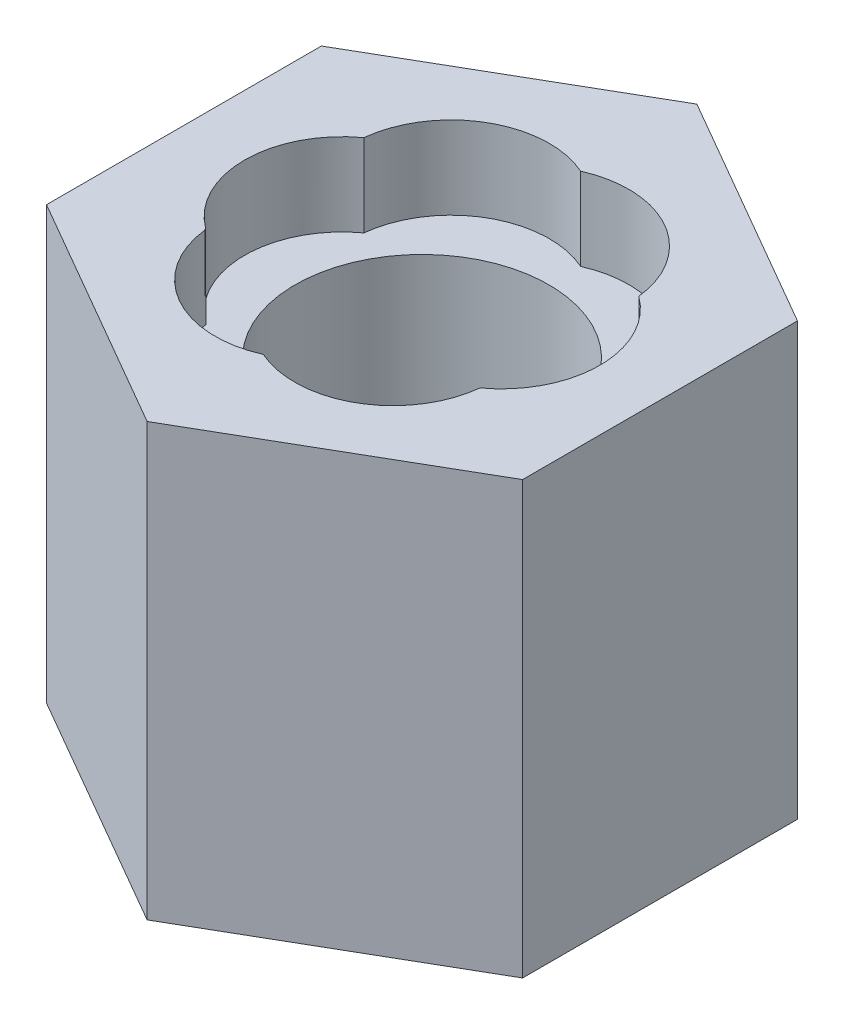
ISO-10303-21;
HEADER;
FILE_DESCRIPTION(('STEP AP214'),'2;1');
FILE_NAME('part.step','',(''),(''),'','','');
FILE_SCHEMA(('AUTOMOTIVE_DESIGN { 1 0 10303 214 1 1 1 1 }'));
ENDSEC;
DATA;
#1=APPLICATION_CONTEXT('core data for automotive mechanical design processes');
#2=APPLICATION_PROTOCOL_DEFINITION('international standard','automotive_design',2000,#1);
#3=PRODUCT_CONTEXT('',#1,'mechanical');
#4=PRODUCT('Part','Part','',(#3));
#5=PRODUCT_RELATED_PRODUCT_CATEGORY('part','',(#4));
#6=PRODUCT_DEFINITION_FORMATION('','',#4);
#7=PRODUCT_DEFINITION_CONTEXT('part definition',#1,'design');
#8=PRODUCT_DEFINITION('design','',#6,#7);
#9=PRODUCT_DEFINITION_SHAPE('','',#8);
#10=(LENGTH_UNIT() NAMED_UNIT(*) SI_UNIT(.MILLI.,.METRE.));
#11=(NAMED_UNIT(*) PLANE_ANGLE_UNIT() SI_UNIT($,.RADIAN.));
#12=(NAMED_UNIT(*) SI_UNIT($,.STERADIAN.) SOLID_ANGLE_UNIT());
#13=UNCERTAINTY_MEASURE_WITH_UNIT(LENGTH_MEASURE(1.E-05),#10,'distance_accuracy_value','');
#14=(GEOMETRIC_REPRESENTATION_CONTEXT(3) GLOBAL_UNCERTAINTY_ASSIGNED_CONTEXT((#13)) GLOBAL_UNIT_ASSIGNED_CONTEXT((#10,
#11,#12)) REPRESENTATION_CONTEXT('',''));
#15=CARTESIAN_POINT('',(0.,0.,0.));
#16=DIRECTION('',(0.,0.,1.));
#17=DIRECTION('',(1.,0.,0.));
#18=AXIS2_PLACEMENT_3D('',#15,#16,#17);
#19=CARTESIAN_POINT('',(37.4999999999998,10.,-64.95));
#20=DIRECTION('',(0.,1.,0.));
#21=DIRECTION('',(0.,0.,1.));
#22=AXIS2_PLACEMENT_3D('',#19,#20,#21);
#23=CYLINDRICAL_SURFACE('',#22,10.);
#24=CARTESIAN_POINT('',(37.4999999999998,0.,-64.95));
#25=DIRECTION('',(0.,1.,0.));
#26=DIRECTION('',(0.,0.,1.));
#27=AXIS2_PLACEMENT_3D('',#24,#25,#26);
#28=CIRCLE('',#27,10.);
#29=CARTESIAN_POINT('',(37.4999999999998,0.,-54.95));
#30=VERTEX_POINT('',#29);
#31=EDGE_CURVE('E180',#30,#30,#28,.T.);
#32=ORIENTED_EDGE('',*,*,#31,.F.);
#33=EDGE_LOOP('',(#32));
#34=FACE_BOUND('',#33,.T.);
#35=CARTESIAN_POINT('',(37.4999999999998,27.5,-64.95));
#36=DIRECTION('',(0.,1.,0.));
#37=DIRECTION('',(0.,0.,1.));
#38=AXIS2_PLACEMENT_3D('',#35,#36,#37);
#39=CIRCLE('',#38,10.);
#40=CARTESIAN_POINT('',(37.4999999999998,27.5,-54.95));
#41=VERTEX_POINT('',#40);
#42=EDGE_CURVE('E436',#41,#41,#39,.T.);
#43=ORIENTED_EDGE('',*,*,#42,.T.);
#44=EDGE_LOOP('',(#43));
#45=FACE_BOUND('',#44,.T.);
#46=ADVANCED_FACE('F33',(#34,#45),#23,.F.);
#47=CARTESIAN_POINT('',(-39.812134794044,34.,-64.95));
#48=DIRECTION('',(0.,1.,0.));
#49=DIRECTION('',(0.,0.,1.));
#50=AXIS2_PLACEMENT_3D('',#47,#48,#49);
#51=PLANE('',#50);
#52=DIRECTION('',(-0.866025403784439,0.,-0.5));
#53=VECTOR('',#52,1.);
#54=CARTESIAN_POINT('',(-11.1091010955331,34.,-114.665112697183));
#55=LINE('',#54,#53);
#56=CARTESIAN_POINT('',(56.2499999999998,34.,-75.7753175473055));
#57=VERTEX_POINT('',#56);
#58=CARTESIAN_POINT('',(37.4999999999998,34.,-86.600635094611));
#59=VERTEX_POINT('',#58);
#60=EDGE_CURVE('E144',#57,#59,#55,.T.);
#61=ORIENTED_EDGE('',*,*,#60,.T.);
#62=DIRECTION('',(-0.866025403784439,0.,0.499999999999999));
#63=VECTOR('',#62,1.);
#64=CARTESIAN_POINT('',(-29.8591010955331,34.,-47.7108399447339));
#65=LINE('',#64,#63);
#66=CARTESIAN_POINT('',(18.7499999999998,34.,-75.7753175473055));
#67=VERTEX_POINT('',#66);
#68=EDGE_CURVE('E93',#59,#67,#65,.T.);
#69=ORIENTED_EDGE('',*,*,#68,.T.);
#70=DIRECTION('',(0.,0.,-1.));
#71=VECTOR('',#70,1.);
#72=CARTESIAN_POINT('',(18.7499999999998,34.,-64.95));
#73=LINE('',#72,#71);
#74=CARTESIAN_POINT('',(18.7499999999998,34.,-54.1246824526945));
#75=VERTEX_POINT('',#74);
#76=EDGE_CURVE('E111',#75,#67,#73,.T.);
#77=ORIENTED_EDGE('',*,*,#76,.F.);
#78=DIRECTION('',(0.866025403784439,0.,0.5));
#79=VECTOR('',#78,1.);
#80=CARTESIAN_POINT('',(-29.859101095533,34.,-82.1891600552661));
#81=LINE('',#80,#79);
#82=CARTESIAN_POINT('',(37.4999999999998,34.,-43.299364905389));
#83=VERTEX_POINT('',#82);
#84=EDGE_CURVE('E103',#75,#83,#81,.T.);
#85=ORIENTED_EDGE('',*,*,#84,.T.);
#86=DIRECTION('',(0.866025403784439,0.,-0.5));
#87=VECTOR('',#86,1.);
#88=CARTESIAN_POINT('',(-11.109101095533,34.,-15.2348873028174));
#89=LINE('',#88,#87);
#90=CARTESIAN_POINT('',(56.2499999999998,34.,-54.1246824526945));
#91=VERTEX_POINT('',#90);
#92=EDGE_CURVE('E108',#83,#91,#89,.T.);
#93=ORIENTED_EDGE('',*,*,#92,.T.);
#94=DIRECTION('',(0.,0.,-1.));
#95=VECTOR('',#94,1.);
#96=CARTESIAN_POINT('',(56.2499999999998,34.,-64.95));
#97=LINE('',#96,#95);
#98=EDGE_CURVE('E57',#91,#57,#97,.T.);
#99=ORIENTED_EDGE('',*,*,#98,.T.);
#100=EDGE_LOOP('',(#61,#69,#77,#85,#93,#99));
#101=FACE_BOUND('',#100,.T.);
#102=CARTESIAN_POINT('',(40.6302343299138,34.,-59.5282751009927));
#103=DIRECTION('',(0.,1.,0.));
#104=DIRECTION('',(0.,0.,1.));
#105=AXIS2_PLACEMENT_3D('',#102,#103,#104);
#106=CIRCLE('',#105,7.73953134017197);
#107=CARTESIAN_POINT('',(48.3253175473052,34.,-58.7));
#108=VERTEX_POINT('',#107);
#109=CARTESIAN_POINT('',(37.4999999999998,34.,-52.45));
#110=VERTEX_POINT('',#109);
#111=EDGE_CURVE('E413',#108,#110,#106,.F.);
#112=ORIENTED_EDGE('',*,*,#111,.T.);
#113=CARTESIAN_POINT('',(34.3671378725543,34.,-59.4777451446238));
#114=DIRECTION('',(0.,1.,0.));
#115=DIRECTION('',(0.,0.,1.));
#116=AXIS2_PLACEMENT_3D('',#113,#114,#115);
#117=CIRCLE('',#116,7.69441530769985);
#118=CARTESIAN_POINT('',(26.7205431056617,34.,-58.6212316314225));
#119=VERTEX_POINT('',#118);
#120=EDGE_CURVE('E408',#110,#119,#117,.F.);
#121=ORIENTED_EDGE('',*,*,#120,.T.);
#122=CARTESIAN_POINT('',(37.4999999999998,34.,-64.95));
#123=DIRECTION('',(0.,1.,0.));
#124=DIRECTION('',(0.,0.,1.));
#125=AXIS2_PLACEMENT_3D('',#122,#123,#124);
#126=CIRCLE('',#125,12.5);
#127=CARTESIAN_POINT('',(26.6293920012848,34.,-58.7791101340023));
#128=VERTEX_POINT('',#127);
#129=EDGE_CURVE('E134',#128,#119,#126,.T.);
#130=ORIENTED_EDGE('',*,*,#129,.F.);
#131=CARTESIAN_POINT('',(31.1944518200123,34.,-64.9729920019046));
#132=DIRECTION('',(0.,1.,0.));
#133=DIRECTION('',(0.,0.,1.));
#134=AXIS2_PLACEMENT_3D('',#131,#132,#133);
#135=CIRCLE('',#134,7.69440990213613);
#136=CARTESIAN_POINT('',(26.6746824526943,34.,-71.2));
#137=VERTEX_POINT('',#136);
#138=EDGE_CURVE('E415',#137,#128,#135,.T.);
#139=ORIENTED_EDGE('',*,*,#138,.F.);
#140=CARTESIAN_POINT('',(34.3697656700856,34.,-70.3717248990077));
#141=DIRECTION('',(0.,1.,0.));
#142=DIRECTION('',(0.,0.,1.));
#143=AXIS2_PLACEMENT_3D('',#140,#141,#142);
#144=CIRCLE('',#143,7.73953134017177);
#145=CARTESIAN_POINT('',(37.4999999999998,34.,-77.45));
#146=VERTEX_POINT('',#145);
#147=EDGE_CURVE('E420',#146,#137,#144,.T.);
#148=ORIENTED_EDGE('',*,*,#147,.F.);
#149=CARTESIAN_POINT('',(40.6302343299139,34.,-70.3717248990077));
#150=DIRECTION('',(0.,1.,0.));
#151=DIRECTION('',(0.,0.,1.));
#152=AXIS2_PLACEMENT_3D('',#149,#150,#151);
#153=CIRCLE('',#152,7.73953134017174);
#154=CARTESIAN_POINT('',(48.3253175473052,34.,-71.2000000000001));
#155=VERTEX_POINT('',#154);
#156=EDGE_CURVE('E483',#146,#155,#153,.F.);
#157=ORIENTED_EDGE('',*,*,#156,.T.);
#158=CARTESIAN_POINT('',(43.7604686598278,34.,-64.9500000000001));
#159=DIRECTION('',(0.,1.,0.));
#160=DIRECTION('',(0.,0.,1.));
#161=AXIS2_PLACEMENT_3D('',#158,#159,#160);
#162=CIRCLE('',#161,7.73953134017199);
#163=EDGE_CURVE('E481',#155,#108,#162,.F.);
#164=ORIENTED_EDGE('',*,*,#163,.T.);
#165=EDGE_LOOP('',(#112,#121,#130,#139,#148,#157,#164));
#166=FACE_BOUND('',#165,.T.);
#167=ADVANCED_FACE('F105',(#101,#166),#51,.T.);
#168=CARTESIAN_POINT('',(37.4999999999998,30.,-64.95));
#169=DIRECTION('',(0.,1.,0.));
#170=DIRECTION('',(0.,0.,1.));
#171=AXIS2_PLACEMENT_3D('',#168,#169,#170);
#172=CYLINDRICAL_SURFACE('',#171,12.5);
#173=DIRECTION('',(0.,1.,0.));
#174=VECTOR('',#173,1.);
#175=CARTESIAN_POINT('',(26.7205431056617,30.75,-58.6212316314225));
#176=LINE('',#175,#174);
#177=CARTESIAN_POINT('',(26.7205431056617,29.5,-58.6212316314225));
#178=VERTEX_POINT('',#177);
#179=EDGE_CURVE('E181',#178,#119,#176,.T.);
#180=ORIENTED_EDGE('',*,*,#179,.F.);
#181=CARTESIAN_POINT('',(37.4999999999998,29.5,-64.95));
#182=DIRECTION('',(0.,1.,0.));
#183=DIRECTION('',(0.,0.,1.));
#184=AXIS2_PLACEMENT_3D('',#181,#182,#183);
#185=CIRCLE('',#184,12.5);
#186=CARTESIAN_POINT('',(26.6293920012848,29.5,-58.7791101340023));
#187=VERTEX_POINT('',#186);
#188=EDGE_CURVE('E178',#187,#178,#185,.T.);
#189=ORIENTED_EDGE('',*,*,#188,.F.);
#190=DIRECTION('',(0.,1.,0.));
#191=VECTOR('',#190,1.);
#192=CARTESIAN_POINT('',(26.6293920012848,30.75,-58.7791101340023));
#193=LINE('',#192,#191);
#194=EDGE_CURVE('E48',#187,#128,#193,.T.);
#195=ORIENTED_EDGE('',*,*,#194,.T.);
#196=ORIENTED_EDGE('',*,*,#129,.T.);
#197=EDGE_LOOP('',(#180,#189,#195,#196));
#198=FACE_BOUND('',#197,.T.);
#199=ADVANCED_FACE('F214',(#198),#172,.F.);
#200=CARTESIAN_POINT('',(37.4999999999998,29.5,-64.95));
#201=DIRECTION('',(0.,1.,0.));
#202=DIRECTION('',(0.,0.,1.));
#203=AXIS2_PLACEMENT_3D('',#200,#201,#202);
#204=PLANE('',#203);
#205=ORIENTED_EDGE('',*,*,#188,.T.);
#206=CARTESIAN_POINT('',(34.3671378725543,29.5,-59.4777451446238));
#207=DIRECTION('',(0.,1.,0.));
#208=DIRECTION('',(0.,0.,1.));
#209=AXIS2_PLACEMENT_3D('',#206,#207,#208);
#210=CIRCLE('',#209,7.69441530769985);
#211=CARTESIAN_POINT('',(26.7100809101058,29.5,-58.7204436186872));
#212=VERTEX_POINT('',#211);
#213=EDGE_CURVE('E11',#178,#212,#210,.F.);
#214=ORIENTED_EDGE('',*,*,#213,.T.);
#215=CARTESIAN_POINT('',(31.1944518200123,29.5,-64.9729920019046));
#216=DIRECTION('',(0.,1.,0.));
#217=DIRECTION('',(0.,0.,1.));
#218=AXIS2_PLACEMENT_3D('',#215,#216,#217);
#219=CIRCLE('',#218,7.69440990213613);
#220=EDGE_CURVE('E41',#187,#212,#219,.T.);
#221=ORIENTED_EDGE('',*,*,#220,.F.);
#222=EDGE_LOOP('',(#205,#214,#221));
#223=FACE_BOUND('',#222,.T.);
#224=ADVANCED_FACE('F177',(#223),#204,.T.);
#225=CARTESIAN_POINT('',(-11.1091010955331,34.,-114.665112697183));
#226=DIRECTION('',(-0.5,0.,0.866025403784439));
#227=DIRECTION('',(0.866025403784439,0.,0.5));
#228=AXIS2_PLACEMENT_3D('',#225,#226,#227);
#229=PLANE('',#228);
#230=DIRECTION('',(-0.866025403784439,0.,-0.5));
#231=VECTOR('',#230,1.);
#232=CARTESIAN_POINT('',(-11.1091010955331,0.,-114.665112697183));
#233=LINE('',#232,#231);
#234=CARTESIAN_POINT('',(56.2499999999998,0.,-75.7753175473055));
#235=VERTEX_POINT('',#234);
#236=CARTESIAN_POINT('',(37.4999999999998,0.,-86.600635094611));
#237=VERTEX_POINT('',#236);
#238=EDGE_CURVE('E130',#235,#237,#233,.T.);
#239=ORIENTED_EDGE('',*,*,#238,.T.);
#240=DIRECTION('',(0.,-1.,0.));
#241=VECTOR('',#240,1.);
#242=CARTESIAN_POINT('',(37.4999999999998,34.,-86.600635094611));
#243=LINE('',#242,#241);
#244=EDGE_CURVE('E150',#59,#237,#243,.T.);
#245=ORIENTED_EDGE('',*,*,#244,.F.);
#246=ORIENTED_EDGE('',*,*,#60,.F.);
#247=DIRECTION('',(0.,-1.,0.));
#248=VECTOR('',#247,1.);
#249=CARTESIAN_POINT('',(56.2499999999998,34.,-75.7753175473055));
#250=LINE('',#249,#248);
#251=EDGE_CURVE('E126',#57,#235,#250,.T.);
#252=ORIENTED_EDGE('',*,*,#251,.T.);
#253=EDGE_LOOP('',(#239,#245,#246,#252));
#254=FACE_BOUND('',#253,.T.);
#255=ADVANCED_FACE('F35',(#254),#229,.F.);
#256=CARTESIAN_POINT('',(-29.8591010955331,34.,-47.7108399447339));
#257=DIRECTION('',(0.499999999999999,0.,0.866025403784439));
#258=DIRECTION('',(0.866025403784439,0.,-0.499999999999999));
#259=AXIS2_PLACEMENT_3D('',#256,#257,#258);
#260=PLANE('',#259);
#261=DIRECTION('',(-0.866025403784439,0.,0.499999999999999));
#262=VECTOR('',#261,1.);
#263=CARTESIAN_POINT('',(-29.8591010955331,0.,-47.7108399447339));
#264=LINE('',#263,#262);
#265=CARTESIAN_POINT('',(18.7499999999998,0.,-75.7753175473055));
#266=VERTEX_POINT('',#265);
#267=EDGE_CURVE('E133',#237,#266,#264,.T.);
#268=ORIENTED_EDGE('',*,*,#267,.T.);
#269=DIRECTION('',(0.,-1.,0.));
#270=VECTOR('',#269,1.);
#271=CARTESIAN_POINT('',(18.7499999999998,34.,-75.7753175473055));
#272=LINE('',#271,#270);
#273=EDGE_CURVE('E148',#67,#266,#272,.T.);
#274=ORIENTED_EDGE('',*,*,#273,.F.);
#275=ORIENTED_EDGE('',*,*,#68,.F.);
#276=ORIENTED_EDGE('',*,*,#244,.T.);
#277=EDGE_LOOP('',(#268,#274,#275,#276));
#278=FACE_BOUND('',#277,.T.);
#279=ADVANCED_FACE('F201',(#278),#260,.F.);
#280=CARTESIAN_POINT('',(18.7499999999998,34.,-64.95));
#281=DIRECTION('',(-1.,0.,0.));
#282=DIRECTION('',(0.,0.,1.));
#283=AXIS2_PLACEMENT_3D('',#280,#281,#282);
#284=PLANE('',#283);
#285=DIRECTION('',(0.,0.,-1.));
#286=VECTOR('',#285,1.);
#287=CARTESIAN_POINT('',(18.7499999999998,0.,-64.95));
#288=LINE('',#287,#286);
#289=CARTESIAN_POINT('',(18.7499999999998,0.,-54.1246824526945));
#290=VERTEX_POINT('',#289);
#291=EDGE_CURVE('E137',#290,#266,#288,.T.);
#292=ORIENTED_EDGE('',*,*,#291,.F.);
#293=DIRECTION('',(0.,-1.,0.));
#294=VECTOR('',#293,1.);
#295=CARTESIAN_POINT('',(18.7499999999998,34.,-54.1246824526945));
#296=LINE('',#295,#294);
#297=EDGE_CURVE('E121',#75,#290,#296,.T.);
#298=ORIENTED_EDGE('',*,*,#297,.F.);
#299=ORIENTED_EDGE('',*,*,#76,.T.);
#300=ORIENTED_EDGE('',*,*,#273,.T.);
#301=EDGE_LOOP('',(#292,#298,#299,#300));
#302=FACE_BOUND('',#301,.T.);
#303=ADVANCED_FACE('F193',(#302),#284,.T.);
#304=CARTESIAN_POINT('',(-29.859101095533,34.,-82.1891600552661));
#305=DIRECTION('',(0.5,0.,-0.866025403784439));
#306=DIRECTION('',(-0.866025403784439,0.,-0.5));
#307=AXIS2_PLACEMENT_3D('',#304,#305,#306);
#308=PLANE('',#307);
#309=DIRECTION('',(0.866025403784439,0.,0.5));
#310=VECTOR('',#309,1.);
#311=CARTESIAN_POINT('',(-29.859101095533,0.,-82.1891600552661));
#312=LINE('',#311,#310);
#313=CARTESIAN_POINT('',(37.4999999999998,0.,-43.299364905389));
#314=VERTEX_POINT('',#313);
#315=EDGE_CURVE('E118',#290,#314,#312,.T.);
#316=ORIENTED_EDGE('',*,*,#315,.T.);
#317=DIRECTION('',(0.,-1.,0.));
#318=VECTOR('',#317,1.);
#319=CARTESIAN_POINT('',(37.4999999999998,34.,-43.299364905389));
#320=LINE('',#319,#318);
#321=EDGE_CURVE('E115',#83,#314,#320,.T.);
#322=ORIENTED_EDGE('',*,*,#321,.F.);
#323=ORIENTED_EDGE('',*,*,#84,.F.);
#324=ORIENTED_EDGE('',*,*,#297,.T.);
#325=EDGE_LOOP('',(#316,#322,#323,#324));
#326=FACE_BOUND('',#325,.T.);
#327=ADVANCED_FACE('F116',(#326),#308,.F.);
#328=CARTESIAN_POINT('',(-11.109101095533,34.,-15.2348873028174));
#329=DIRECTION('',(-0.5,0.,-0.866025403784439));
#330=DIRECTION('',(-0.866025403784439,0.,0.5));
#331=AXIS2_PLACEMENT_3D('',#328,#329,#330);
#332=PLANE('',#331);
#333=DIRECTION('',(0.866025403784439,0.,-0.5));
#334=VECTOR('',#333,1.);
#335=CARTESIAN_POINT('',(-11.109101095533,0.,-15.2348873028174));
#336=LINE('',#335,#334);
#337=CARTESIAN_POINT('',(56.2499999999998,0.,-54.1246824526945));
#338=VERTEX_POINT('',#337);
#339=EDGE_CURVE('E141',#314,#338,#336,.T.);
#340=ORIENTED_EDGE('',*,*,#339,.T.);
#341=DIRECTION('',(0.,-1.,0.));
#342=VECTOR('',#341,1.);
#343=CARTESIAN_POINT('',(56.2499999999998,34.,-54.1246824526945));
#344=LINE('',#343,#342);
#345=EDGE_CURVE('E122',#91,#338,#344,.T.);
#346=ORIENTED_EDGE('',*,*,#345,.F.);
#347=ORIENTED_EDGE('',*,*,#92,.F.);
#348=ORIENTED_EDGE('',*,*,#321,.T.);
#349=EDGE_LOOP('',(#340,#346,#347,#348));
#350=FACE_BOUND('',#349,.T.);
#351=ADVANCED_FACE('F124',(#350),#332,.F.);
#352=CARTESIAN_POINT('',(56.2499999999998,34.,-64.95));
#353=DIRECTION('',(-1.,0.,0.));
#354=DIRECTION('',(0.,0.,1.));
#355=AXIS2_PLACEMENT_3D('',#352,#353,#354);
#356=PLANE('',#355);
#357=DIRECTION('',(0.,0.,-1.));
#358=VECTOR('',#357,1.);
#359=CARTESIAN_POINT('',(56.2499999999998,0.,-64.95));
#360=LINE('',#359,#358);
#361=EDGE_CURVE('E84',#338,#235,#360,.T.);
#362=ORIENTED_EDGE('',*,*,#361,.T.);
#363=ORIENTED_EDGE('',*,*,#251,.F.);
#364=ORIENTED_EDGE('',*,*,#98,.F.);
#365=ORIENTED_EDGE('',*,*,#345,.T.);
#366=EDGE_LOOP('',(#362,#363,#364,#365));
#367=FACE_BOUND('',#366,.T.);
#368=ADVANCED_FACE('F197',(#367),#356,.F.);
#369=CARTESIAN_POINT('',(-39.812134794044,0.,-64.95));
#370=DIRECTION('',(0.,1.,0.));
#371=DIRECTION('',(0.,0.,1.));
#372=AXIS2_PLACEMENT_3D('',#369,#370,#371);
#373=PLANE('',#372);
#374=ORIENTED_EDGE('',*,*,#31,.T.);
#375=EDGE_LOOP('',(#374));
#376=FACE_BOUND('',#375,.T.);
#377=ORIENTED_EDGE('',*,*,#238,.F.);
#378=ORIENTED_EDGE('',*,*,#361,.F.);
#379=ORIENTED_EDGE('',*,*,#339,.F.);
#380=ORIENTED_EDGE('',*,*,#315,.F.);
#381=ORIENTED_EDGE('',*,*,#291,.T.);
#382=ORIENTED_EDGE('',*,*,#267,.F.);
#383=EDGE_LOOP('',(#377,#378,#379,#380,#381,#382));
#384=FACE_BOUND('',#383,.T.);
#385=ADVANCED_FACE('F196',(#376,#384),#373,.F.);
#386=CARTESIAN_POINT('',(34.3671378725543,27.5,-59.4777451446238));
#387=DIRECTION('',(0.,1.,0.));
#388=DIRECTION('',(0.,0.,1.));
#389=AXIS2_PLACEMENT_3D('',#386,#387,#388);
#390=CYLINDRICAL_SURFACE('',#389,7.69441530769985);
#391=ORIENTED_EDGE('',*,*,#179,.T.);
#392=ORIENTED_EDGE('',*,*,#120,.F.);
#393=DIRECTION('',(0.,1.,0.));
#394=VECTOR('',#393,1.);
#395=CARTESIAN_POINT('',(37.4999999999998,27.5,-52.45));
#396=LINE('',#395,#394);
#397=CARTESIAN_POINT('',(37.4999999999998,27.5,-52.45));
#398=VERTEX_POINT('',#397);
#399=EDGE_CURVE('E174',#398,#110,#396,.T.);
#400=ORIENTED_EDGE('',*,*,#399,.F.);
#401=CARTESIAN_POINT('',(34.3671378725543,27.5,-59.4777451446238));
#402=DIRECTION('',(0.,1.,0.));
#403=DIRECTION('',(0.,0.,1.));
#404=AXIS2_PLACEMENT_3D('',#401,#402,#403);
#405=CIRCLE('',#404,7.69441530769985);
#406=CARTESIAN_POINT('',(26.7100809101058,27.5,-58.7204436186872));
#407=VERTEX_POINT('',#406);
#408=EDGE_CURVE('E173',#398,#407,#405,.F.);
#409=ORIENTED_EDGE('',*,*,#408,.T.);
#410=DIRECTION('',(0.,1.,0.));
#411=VECTOR('',#410,1.);
#412=CARTESIAN_POINT('',(26.7100809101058,27.5,-58.7204436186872));
#413=LINE('',#412,#411);
#414=EDGE_CURVE('E157',#407,#212,#413,.T.);
#415=ORIENTED_EDGE('',*,*,#414,.T.);
#416=ORIENTED_EDGE('',*,*,#213,.F.);
#417=EDGE_LOOP('',(#391,#392,#400,#409,#415,#416));
#418=FACE_BOUND('',#417,.T.);
#419=ADVANCED_FACE('F169',(#418),#390,.F.);
#420=CARTESIAN_POINT('',(31.1944518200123,27.5,-64.9729920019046));
#421=DIRECTION('',(0.,1.,0.));
#422=DIRECTION('',(0.,0.,1.));
#423=AXIS2_PLACEMENT_3D('',#420,#421,#422);
#424=CYLINDRICAL_SURFACE('',#423,7.69440990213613);
#425=ORIENTED_EDGE('',*,*,#220,.T.);
#426=ORIENTED_EDGE('',*,*,#414,.F.);
#427=CARTESIAN_POINT('',(31.1944518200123,27.5,-64.9729920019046));
#428=DIRECTION('',(0.,1.,0.));
#429=DIRECTION('',(0.,0.,1.));
#430=AXIS2_PLACEMENT_3D('',#427,#428,#429);
#431=CIRCLE('',#430,7.69440990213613);
#432=CARTESIAN_POINT('',(26.6746824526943,27.5,-71.2));
#433=VERTEX_POINT('',#432);
#434=EDGE_CURVE('E472',#433,#407,#431,.T.);
#435=ORIENTED_EDGE('',*,*,#434,.F.);
#436=DIRECTION('',(0.,1.,0.));
#437=VECTOR('',#436,1.);
#438=CARTESIAN_POINT('',(26.6746824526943,27.5,-71.2));
#439=LINE('',#438,#437);
#440=EDGE_CURVE('E175',#433,#137,#439,.T.);
#441=ORIENTED_EDGE('',*,*,#440,.T.);
#442=ORIENTED_EDGE('',*,*,#138,.T.);
#443=ORIENTED_EDGE('',*,*,#194,.F.);
#444=EDGE_LOOP('',(#425,#426,#435,#441,#442,#443));
#445=FACE_BOUND('',#444,.T.);
#446=ADVANCED_FACE('F154',(#445),#424,.F.);
#447=CARTESIAN_POINT('',(40.6302343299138,27.5,-59.5282751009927));
#448=DIRECTION('',(0.,1.,0.));
#449=DIRECTION('',(0.,0.,1.));
#450=AXIS2_PLACEMENT_3D('',#447,#448,#449);
#451=CYLINDRICAL_SURFACE('',#450,7.73953134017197);
#452=ORIENTED_EDGE('',*,*,#111,.F.);
#453=DIRECTION('',(0.,1.,0.));
#454=VECTOR('',#453,1.);
#455=CARTESIAN_POINT('',(48.3253175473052,27.5,-58.7));
#456=LINE('',#455,#454);
#457=CARTESIAN_POINT('',(48.3253175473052,27.5,-58.7));
#458=VERTEX_POINT('',#457);
#459=EDGE_CURVE('E434',#458,#108,#456,.T.);
#460=ORIENTED_EDGE('',*,*,#459,.F.);
#461=CARTESIAN_POINT('',(40.6302343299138,27.5,-59.5282751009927));
#462=DIRECTION('',(0.,1.,0.));
#463=DIRECTION('',(0.,0.,1.));
#464=AXIS2_PLACEMENT_3D('',#461,#462,#463);
#465=CIRCLE('',#464,7.73953134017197);
#466=EDGE_CURVE('E414',#458,#398,#465,.F.);
#467=ORIENTED_EDGE('',*,*,#466,.T.);
#468=ORIENTED_EDGE('',*,*,#399,.T.);
#469=EDGE_LOOP('',(#452,#460,#467,#468));
#470=FACE_BOUND('',#469,.T.);
#471=ADVANCED_FACE('F258',(#470),#451,.F.);
#472=CARTESIAN_POINT('',(34.3697656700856,27.5,-70.3717248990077));
#473=DIRECTION('',(0.,1.,0.));
#474=DIRECTION('',(0.,0.,1.));
#475=AXIS2_PLACEMENT_3D('',#472,#473,#474);
#476=CYLINDRICAL_SURFACE('',#475,7.73953134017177);
#477=ORIENTED_EDGE('',*,*,#147,.T.);
#478=ORIENTED_EDGE('',*,*,#440,.F.);
#479=CARTESIAN_POINT('',(34.3697656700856,27.5,-70.3717248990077));
#480=DIRECTION('',(0.,1.,0.));
#481=DIRECTION('',(0.,0.,1.));
#482=AXIS2_PLACEMENT_3D('',#479,#480,#481);
#483=CIRCLE('',#482,7.73953134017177);
#484=CARTESIAN_POINT('',(37.4999999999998,27.5,-77.45));
#485=VERTEX_POINT('',#484);
#486=EDGE_CURVE('E476',#485,#433,#483,.T.);
#487=ORIENTED_EDGE('',*,*,#486,.F.);
#488=DIRECTION('',(0.,1.,0.));
#489=VECTOR('',#488,1.);
#490=CARTESIAN_POINT('',(37.4999999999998,27.5,-77.45));
#491=LINE('',#490,#489);
#492=EDGE_CURVE('E428',#485,#146,#491,.T.);
#493=ORIENTED_EDGE('',*,*,#492,.T.);
#494=EDGE_LOOP('',(#477,#478,#487,#493));
#495=FACE_BOUND('',#494,.T.);
#496=ADVANCED_FACE('F265',(#495),#476,.F.);
#497=CARTESIAN_POINT('',(40.6302343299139,27.5,-70.3717248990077));
#498=DIRECTION('',(0.,1.,0.));
#499=DIRECTION('',(0.,0.,1.));
#500=AXIS2_PLACEMENT_3D('',#497,#498,#499);
#501=CYLINDRICAL_SURFACE('',#500,7.73953134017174);
#502=ORIENTED_EDGE('',*,*,#156,.F.);
#503=ORIENTED_EDGE('',*,*,#492,.F.);
#504=CARTESIAN_POINT('',(40.6302343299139,27.5,-70.3717248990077));
#505=DIRECTION('',(0.,1.,0.));
#506=DIRECTION('',(0.,0.,1.));
#507=AXIS2_PLACEMENT_3D('',#504,#505,#506);
#508=CIRCLE('',#507,7.73953134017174);
#509=CARTESIAN_POINT('',(48.3253175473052,27.5,-71.2000000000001));
#510=VERTEX_POINT('',#509);
#511=EDGE_CURVE('E468',#485,#510,#508,.F.);
#512=ORIENTED_EDGE('',*,*,#511,.T.);
#513=DIRECTION('',(0.,1.,0.));
#514=VECTOR('',#513,1.);
#515=CARTESIAN_POINT('',(48.3253175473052,27.5,-71.2000000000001));
#516=LINE('',#515,#514);
#517=EDGE_CURVE('E431',#510,#155,#516,.T.);
#518=ORIENTED_EDGE('',*,*,#517,.T.);
#519=EDGE_LOOP('',(#502,#503,#512,#518));
#520=FACE_BOUND('',#519,.T.);
#521=ADVANCED_FACE('F273',(#520),#501,.F.);
#522=CARTESIAN_POINT('',(43.7604686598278,27.5,-64.9500000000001));
#523=DIRECTION('',(0.,1.,0.));
#524=DIRECTION('',(0.,0.,1.));
#525=AXIS2_PLACEMENT_3D('',#522,#523,#524);
#526=CYLINDRICAL_SURFACE('',#525,7.73953134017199);
#527=ORIENTED_EDGE('',*,*,#163,.F.);
#528=ORIENTED_EDGE('',*,*,#517,.F.);
#529=CARTESIAN_POINT('',(43.7604686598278,27.5,-64.9500000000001));
#530=DIRECTION('',(0.,1.,0.));
#531=DIRECTION('',(0.,0.,1.));
#532=AXIS2_PLACEMENT_3D('',#529,#530,#531);
#533=CIRCLE('',#532,7.73953134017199);
#534=EDGE_CURVE('E418',#510,#458,#533,.F.);
#535=ORIENTED_EDGE('',*,*,#534,.T.);
#536=ORIENTED_EDGE('',*,*,#459,.T.);
#537=EDGE_LOOP('',(#527,#528,#535,#536));
#538=FACE_BOUND('',#537,.T.);
#539=ADVANCED_FACE('F281',(#538),#526,.F.);
#540=CARTESIAN_POINT('',(-7.19651365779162,27.5,-64.95));
#541=DIRECTION('',(0.,1.,0.));
#542=DIRECTION('',(0.,0.,1.));
#543=AXIS2_PLACEMENT_3D('',#540,#541,#542);
#544=PLANE('',#543);
#545=ORIENTED_EDGE('',*,*,#466,.F.);
#546=ORIENTED_EDGE('',*,*,#534,.F.);
#547=ORIENTED_EDGE('',*,*,#511,.F.);
#548=ORIENTED_EDGE('',*,*,#486,.T.);
#549=ORIENTED_EDGE('',*,*,#434,.T.);
#550=ORIENTED_EDGE('',*,*,#408,.F.);
#551=EDGE_LOOP('',(#545,#546,#547,#548,#549,#550));
#552=FACE_BOUND('',#551,.T.);
#553=ORIENTED_EDGE('',*,*,#42,.F.);
#554=EDGE_LOOP('',(#553));
#555=FACE_BOUND('',#554,.T.);
#556=ADVANCED_FACE('F289',(#552,#555),#544,.T.);
#557=CLOSED_SHELL('',(#46,#167,#199,#224,#255,#279,#303,#327,#351,#368,#385,#419,#446,#471,#496,
#521,#539,#556));
#558=MANIFOLD_SOLID_BREP('B2',#557);
#559=ADVANCED_BREP_SHAPE_REPRESENTATION('',(#18,#558),#14);
#560=SHAPE_DEFINITION_REPRESENTATION(#9,#559);
ENDSEC;
END-ISO-10303-21;
